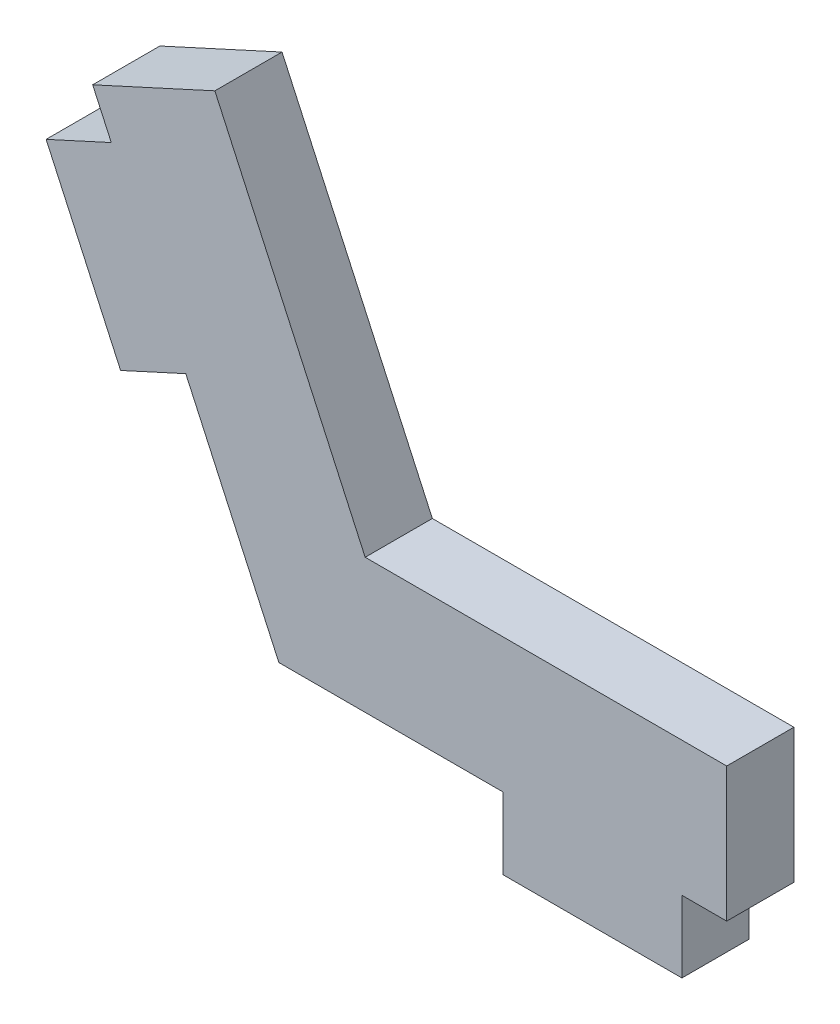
from build123d import *

# Parameters (mm, degrees)
EXTRUDE_1_DEPTH = 3
SKETCH_1_3_W    = 8
SKETCH_1_3_H    = 3.2
EXTRUDE_2_DEPTH = 3


with BuildPart() as part:
    # Sketch 1 → Extrude 1 (new body)
    with BuildSketch(Plane.XY):
        Polygon((20, 6), (20, 0), (0, 0), (-8.316093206, 18.18907897), (-2.859369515, 20.683906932), (3.854150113, 6), align=None)
    extrude(amount=EXTRUDE_1_DEPTH)

    # Sketch 1_3 → Extrude 2 (add)
    with BuildSketch(Plane.XY):
        Polygon((-7.068299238, 7.763964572), (-4.158046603, 9.094539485), (-7.484483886, 16.370171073), (-10.394736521, 15.03959616), align=None)
        with Locations((14, -1.6)):
            Rectangle(SKETCH_1_3_W, SKETCH_1_3_H)
    extrude(amount=EXTRUDE_2_DEPTH)


solid = part.part
